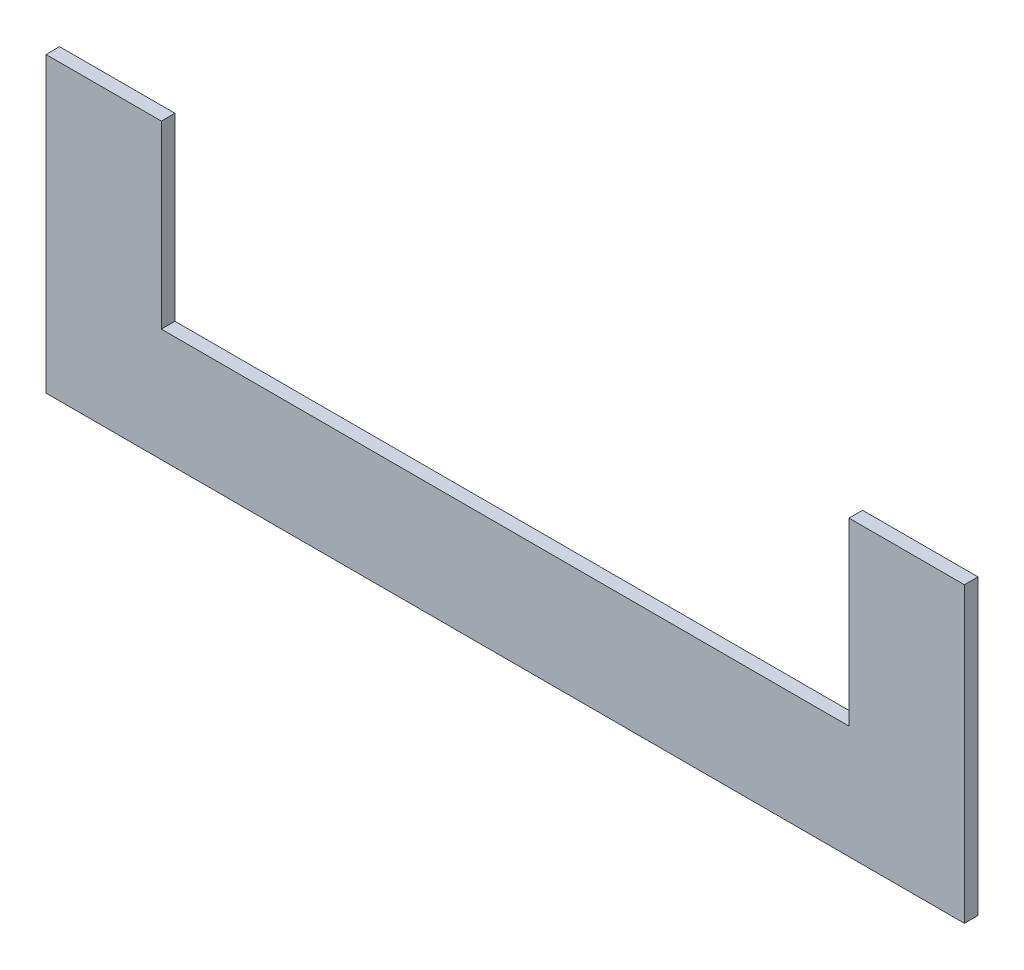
ISO-10303-21;
HEADER;
FILE_DESCRIPTION(('STEP AP214'),'2;1');
FILE_NAME('part.step','',(''),(''),'','','');
FILE_SCHEMA(('AUTOMOTIVE_DESIGN { 1 0 10303 214 1 1 1 1 }'));
ENDSEC;
DATA;
#1=APPLICATION_CONTEXT('core data for automotive mechanical design processes');
#2=APPLICATION_PROTOCOL_DEFINITION('international standard','automotive_design',2000,#1);
#3=PRODUCT_CONTEXT('',#1,'mechanical');
#4=PRODUCT('Part','Part','',(#3));
#5=PRODUCT_RELATED_PRODUCT_CATEGORY('part','',(#4));
#6=PRODUCT_DEFINITION_FORMATION('','',#4);
#7=PRODUCT_DEFINITION_CONTEXT('part definition',#1,'design');
#8=PRODUCT_DEFINITION('design','',#6,#7);
#9=PRODUCT_DEFINITION_SHAPE('','',#8);
#10=(LENGTH_UNIT() NAMED_UNIT(*) SI_UNIT(.MILLI.,.METRE.));
#11=(NAMED_UNIT(*) PLANE_ANGLE_UNIT() SI_UNIT($,.RADIAN.));
#12=(NAMED_UNIT(*) SI_UNIT($,.STERADIAN.) SOLID_ANGLE_UNIT());
#13=UNCERTAINTY_MEASURE_WITH_UNIT(LENGTH_MEASURE(1.E-05),#10,'distance_accuracy_value','');
#14=(GEOMETRIC_REPRESENTATION_CONTEXT(3) GLOBAL_UNCERTAINTY_ASSIGNED_CONTEXT((#13)) GLOBAL_UNIT_ASSIGNED_CONTEXT((#10,
#11,#12)) REPRESENTATION_CONTEXT('',''));
#15=CARTESIAN_POINT('',(0.,0.,0.));
#16=DIRECTION('',(0.,0.,1.));
#17=DIRECTION('',(1.,0.,0.));
#18=AXIS2_PLACEMENT_3D('',#15,#16,#17);
#19=CARTESIAN_POINT('',(-203.,-64.8200000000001,6.));
#20=DIRECTION('',(1.,0.,0.));
#21=DIRECTION('',(0.,0.,-1.));
#22=AXIS2_PLACEMENT_3D('',#19,#20,#21);
#23=PLANE('',#22);
#24=DIRECTION('',(0.,-1.,0.));
#25=VECTOR('',#24,1.);
#26=CARTESIAN_POINT('',(-203.,-64.8200000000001,0.));
#27=LINE('',#26,#25);
#28=CARTESIAN_POINT('',(-203.,64.8199999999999,0.));
#29=VERTEX_POINT('',#28);
#30=CARTESIAN_POINT('',(-203.,-64.8200000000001,0.));
#31=VERTEX_POINT('',#30);
#32=EDGE_CURVE('E128',#29,#31,#27,.T.);
#33=ORIENTED_EDGE('',*,*,#32,.T.);
#34=DIRECTION('',(0.,0.,-1.));
#35=VECTOR('',#34,1.);
#36=CARTESIAN_POINT('',(-203.,-64.8200000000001,6.));
#37=LINE('',#36,#35);
#38=CARTESIAN_POINT('',(-203.,-64.8200000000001,6.));
#39=VERTEX_POINT('',#38);
#40=EDGE_CURVE('E11',#39,#31,#37,.T.);
#41=ORIENTED_EDGE('',*,*,#40,.F.);
#42=DIRECTION('',(0.,-1.,0.));
#43=VECTOR('',#42,1.);
#44=CARTESIAN_POINT('',(-203.,-64.8200000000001,6.));
#45=LINE('',#44,#43);
#46=CARTESIAN_POINT('',(-203.,64.8199999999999,6.));
#47=VERTEX_POINT('',#46);
#48=EDGE_CURVE('E142',#47,#39,#45,.T.);
#49=ORIENTED_EDGE('',*,*,#48,.F.);
#50=DIRECTION('',(0.,0.,-1.));
#51=VECTOR('',#50,1.);
#52=CARTESIAN_POINT('',(-203.,64.8199999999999,6.));
#53=LINE('',#52,#51);
#54=EDGE_CURVE('E124',#47,#29,#53,.T.);
#55=ORIENTED_EDGE('',*,*,#54,.T.);
#56=EDGE_LOOP('',(#33,#41,#49,#55));
#57=FACE_BOUND('',#56,.T.);
#58=ADVANCED_FACE('F32',(#57),#23,.F.);
#59=CARTESIAN_POINT('',(203.,-64.82,6.));
#60=DIRECTION('',(0.,1.,0.));
#61=DIRECTION('',(-1.,0.,0.));
#62=AXIS2_PLACEMENT_3D('',#59,#60,#61);
#63=PLANE('',#62);
#64=DIRECTION('',(1.,0.,0.));
#65=VECTOR('',#64,1.);
#66=CARTESIAN_POINT('',(203.,-64.82,0.));
#67=LINE('',#66,#65);
#68=CARTESIAN_POINT('',(203.,-64.82,0.));
#69=VERTEX_POINT('',#68);
#70=EDGE_CURVE('E131',#31,#69,#67,.T.);
#71=ORIENTED_EDGE('',*,*,#70,.T.);
#72=DIRECTION('',(0.,0.,-1.));
#73=VECTOR('',#72,1.);
#74=CARTESIAN_POINT('',(203.,-64.82,6.));
#75=LINE('',#74,#73);
#76=CARTESIAN_POINT('',(203.,-64.82,6.));
#77=VERTEX_POINT('',#76);
#78=EDGE_CURVE('E40',#77,#69,#75,.T.);
#79=ORIENTED_EDGE('',*,*,#78,.F.);
#80=DIRECTION('',(1.,0.,0.));
#81=VECTOR('',#80,1.);
#82=CARTESIAN_POINT('',(203.,-64.82,6.));
#83=LINE('',#82,#81);
#84=EDGE_CURVE('E91',#39,#77,#83,.T.);
#85=ORIENTED_EDGE('',*,*,#84,.F.);
#86=ORIENTED_EDGE('',*,*,#40,.T.);
#87=EDGE_LOOP('',(#71,#79,#85,#86));
#88=FACE_BOUND('',#87,.T.);
#89=ADVANCED_FACE('F177',(#88),#63,.F.);
#90=CARTESIAN_POINT('',(203.,-64.82,6.));
#91=DIRECTION('',(-1.,0.,0.));
#92=DIRECTION('',(0.,0.,1.));
#93=AXIS2_PLACEMENT_3D('',#90,#91,#92);
#94=PLANE('',#93);
#95=DIRECTION('',(0.,1.,0.));
#96=VECTOR('',#95,1.);
#97=CARTESIAN_POINT('',(203.,-64.82,0.));
#98=LINE('',#97,#96);
#99=CARTESIAN_POINT('',(203.,64.82,0.));
#100=VERTEX_POINT('',#99);
#101=EDGE_CURVE('E133',#69,#100,#98,.T.);
#102=ORIENTED_EDGE('',*,*,#101,.T.);
#103=DIRECTION('',(0.,0.,-1.));
#104=VECTOR('',#103,1.);
#105=CARTESIAN_POINT('',(203.,64.82,6.));
#106=LINE('',#105,#104);
#107=CARTESIAN_POINT('',(203.,64.82,6.));
#108=VERTEX_POINT('',#107);
#109=EDGE_CURVE('E149',#108,#100,#106,.T.);
#110=ORIENTED_EDGE('',*,*,#109,.F.);
#111=DIRECTION('',(0.,1.,0.));
#112=VECTOR('',#111,1.);
#113=CARTESIAN_POINT('',(203.,-64.82,6.));
#114=LINE('',#113,#112);
#115=EDGE_CURVE('E157',#77,#108,#114,.T.);
#116=ORIENTED_EDGE('',*,*,#115,.F.);
#117=ORIENTED_EDGE('',*,*,#78,.T.);
#118=EDGE_LOOP('',(#102,#110,#116,#117));
#119=FACE_BOUND('',#118,.T.);
#120=ADVANCED_FACE('F155',(#119),#94,.F.);
#121=CARTESIAN_POINT('',(152.,64.82,6.));
#122=DIRECTION('',(0.,-1.,0.));
#123=DIRECTION('',(1.,0.,0.));
#124=AXIS2_PLACEMENT_3D('',#121,#122,#123);
#125=PLANE('',#124);
#126=DIRECTION('',(-1.,0.,0.));
#127=VECTOR('',#126,1.);
#128=CARTESIAN_POINT('',(152.,64.82,0.));
#129=LINE('',#128,#127);
#130=CARTESIAN_POINT('',(152.,64.82,0.));
#131=VERTEX_POINT('',#130);
#132=EDGE_CURVE('E135',#100,#131,#129,.T.);
#133=ORIENTED_EDGE('',*,*,#132,.T.);
#134=DIRECTION('',(0.,0.,-1.));
#135=VECTOR('',#134,1.);
#136=CARTESIAN_POINT('',(152.,64.82,6.));
#137=LINE('',#136,#135);
#138=CARTESIAN_POINT('',(152.,64.82,6.));
#139=VERTEX_POINT('',#138);
#140=EDGE_CURVE('E146',#139,#131,#137,.T.);
#141=ORIENTED_EDGE('',*,*,#140,.F.);
#142=DIRECTION('',(-1.,0.,0.));
#143=VECTOR('',#142,1.);
#144=CARTESIAN_POINT('',(152.,64.82,6.));
#145=LINE('',#144,#143);
#146=EDGE_CURVE('E169',#108,#139,#145,.T.);
#147=ORIENTED_EDGE('',*,*,#146,.F.);
#148=ORIENTED_EDGE('',*,*,#109,.T.);
#149=EDGE_LOOP('',(#133,#141,#147,#148));
#150=FACE_BOUND('',#149,.T.);
#151=ADVANCED_FACE('F165',(#150),#125,.F.);
#152=CARTESIAN_POINT('',(152.,-14.82,6.));
#153=DIRECTION('',(1.,0.,0.));
#154=DIRECTION('',(0.,1.,0.));
#155=AXIS2_PLACEMENT_3D('',#152,#153,#154);
#156=PLANE('',#155);
#157=DIRECTION('',(0.,-1.,0.));
#158=VECTOR('',#157,1.);
#159=CARTESIAN_POINT('',(152.,-14.82,0.));
#160=LINE('',#159,#158);
#161=CARTESIAN_POINT('',(152.,-14.82,0.));
#162=VERTEX_POINT('',#161);
#163=EDGE_CURVE('E137',#131,#162,#160,.T.);
#164=ORIENTED_EDGE('',*,*,#163,.T.);
#165=DIRECTION('',(0.,0.,-1.));
#166=VECTOR('',#165,1.);
#167=CARTESIAN_POINT('',(152.,-14.82,6.));
#168=LINE('',#167,#166);
#169=CARTESIAN_POINT('',(152.,-14.82,6.));
#170=VERTEX_POINT('',#169);
#171=EDGE_CURVE('E119',#170,#162,#168,.T.);
#172=ORIENTED_EDGE('',*,*,#171,.F.);
#173=DIRECTION('',(0.,-1.,0.));
#174=VECTOR('',#173,1.);
#175=CARTESIAN_POINT('',(152.,-14.82,6.));
#176=LINE('',#175,#174);
#177=EDGE_CURVE('E110',#139,#170,#176,.T.);
#178=ORIENTED_EDGE('',*,*,#177,.F.);
#179=ORIENTED_EDGE('',*,*,#140,.T.);
#180=EDGE_LOOP('',(#164,#172,#178,#179));
#181=FACE_BOUND('',#180,.T.);
#182=ADVANCED_FACE('F168',(#181),#156,.F.);
#183=CARTESIAN_POINT('',(-152.,-14.82,6.));
#184=DIRECTION('',(0.,-1.,0.));
#185=DIRECTION('',(0.,0.,-1.));
#186=AXIS2_PLACEMENT_3D('',#183,#184,#185);
#187=PLANE('',#186);
#188=DIRECTION('',(-1.,0.,0.));
#189=VECTOR('',#188,1.);
#190=CARTESIAN_POINT('',(-152.,-14.82,0.));
#191=LINE('',#190,#189);
#192=CARTESIAN_POINT('',(-152.,-14.82,0.));
#193=VERTEX_POINT('',#192);
#194=EDGE_CURVE('E118',#162,#193,#191,.T.);
#195=ORIENTED_EDGE('',*,*,#194,.T.);
#196=DIRECTION('',(0.,0.,-1.));
#197=VECTOR('',#196,1.);
#198=CARTESIAN_POINT('',(-152.,-14.82,6.));
#199=LINE('',#198,#197);
#200=CARTESIAN_POINT('',(-152.,-14.82,6.));
#201=VERTEX_POINT('',#200);
#202=EDGE_CURVE('E115',#201,#193,#199,.T.);
#203=ORIENTED_EDGE('',*,*,#202,.F.);
#204=DIRECTION('',(-1.,0.,0.));
#205=VECTOR('',#204,1.);
#206=CARTESIAN_POINT('',(-152.,-14.82,6.));
#207=LINE('',#206,#205);
#208=EDGE_CURVE('E104',#170,#201,#207,.T.);
#209=ORIENTED_EDGE('',*,*,#208,.F.);
#210=ORIENTED_EDGE('',*,*,#171,.T.);
#211=EDGE_LOOP('',(#195,#203,#209,#210));
#212=FACE_BOUND('',#211,.T.);
#213=ADVANCED_FACE('F116',(#212),#187,.F.);
#214=CARTESIAN_POINT('',(-152.,-14.82,6.));
#215=DIRECTION('',(-1.,0.,0.));
#216=DIRECTION('',(0.,0.,1.));
#217=AXIS2_PLACEMENT_3D('',#214,#215,#216);
#218=PLANE('',#217);
#219=DIRECTION('',(0.,1.,0.));
#220=VECTOR('',#219,1.);
#221=CARTESIAN_POINT('',(-152.,-14.82,0.));
#222=LINE('',#221,#220);
#223=CARTESIAN_POINT('',(-152.,64.8199999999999,0.));
#224=VERTEX_POINT('',#223);
#225=EDGE_CURVE('E77',#193,#224,#222,.T.);
#226=ORIENTED_EDGE('',*,*,#225,.T.);
#227=DIRECTION('',(0.,0.,-1.));
#228=VECTOR('',#227,1.);
#229=CARTESIAN_POINT('',(-152.,64.8199999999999,6.));
#230=LINE('',#229,#228);
#231=CARTESIAN_POINT('',(-152.,64.8199999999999,6.));
#232=VERTEX_POINT('',#231);
#233=EDGE_CURVE('E120',#232,#224,#230,.T.);
#234=ORIENTED_EDGE('',*,*,#233,.F.);
#235=DIRECTION('',(0.,1.,0.));
#236=VECTOR('',#235,1.);
#237=CARTESIAN_POINT('',(-152.,-14.82,6.));
#238=LINE('',#237,#236);
#239=EDGE_CURVE('E108',#201,#232,#238,.T.);
#240=ORIENTED_EDGE('',*,*,#239,.F.);
#241=ORIENTED_EDGE('',*,*,#202,.T.);
#242=EDGE_LOOP('',(#226,#234,#240,#241));
#243=FACE_BOUND('',#242,.T.);
#244=ADVANCED_FACE('F122',(#243),#218,.F.);
#245=CARTESIAN_POINT('',(-203.,64.8199999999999,6.));
#246=DIRECTION('',(0.,-1.,0.));
#247=DIRECTION('',(0.,0.,-1.));
#248=AXIS2_PLACEMENT_3D('',#245,#246,#247);
#249=PLANE('',#248);
#250=DIRECTION('',(-1.,0.,0.));
#251=VECTOR('',#250,1.);
#252=CARTESIAN_POINT('',(-203.,64.8199999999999,0.));
#253=LINE('',#252,#251);
#254=EDGE_CURVE('E83',#224,#29,#253,.T.);
#255=ORIENTED_EDGE('',*,*,#254,.T.);
#256=ORIENTED_EDGE('',*,*,#54,.F.);
#257=DIRECTION('',(-1.,0.,0.));
#258=VECTOR('',#257,1.);
#259=CARTESIAN_POINT('',(-203.,64.8199999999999,6.));
#260=LINE('',#259,#258);
#261=EDGE_CURVE('E48',#232,#47,#260,.T.);
#262=ORIENTED_EDGE('',*,*,#261,.F.);
#263=ORIENTED_EDGE('',*,*,#233,.T.);
#264=EDGE_LOOP('',(#255,#256,#262,#263));
#265=FACE_BOUND('',#264,.T.);
#266=ADVANCED_FACE('F193',(#265),#249,.F.);
#267=CARTESIAN_POINT('',(0.,0.,6.));
#268=DIRECTION('',(0.,0.,-1.));
#269=DIRECTION('',(-1.,0.,0.));
#270=AXIS2_PLACEMENT_3D('',#267,#268,#269);
#271=PLANE('',#270);
#272=ORIENTED_EDGE('',*,*,#48,.T.);
#273=ORIENTED_EDGE('',*,*,#84,.T.);
#274=ORIENTED_EDGE('',*,*,#115,.T.);
#275=ORIENTED_EDGE('',*,*,#146,.T.);
#276=ORIENTED_EDGE('',*,*,#177,.T.);
#277=ORIENTED_EDGE('',*,*,#208,.T.);
#278=ORIENTED_EDGE('',*,*,#239,.T.);
#279=ORIENTED_EDGE('',*,*,#261,.T.);
#280=EDGE_LOOP('',(#272,#273,#274,#275,#276,#277,#278,#279));
#281=FACE_BOUND('',#280,.T.);
#282=ADVANCED_FACE('F106',(#281),#271,.F.);
#283=CARTESIAN_POINT('',(0.,0.,0.));
#284=DIRECTION('',(0.,0.,-1.));
#285=DIRECTION('',(-1.,0.,0.));
#286=AXIS2_PLACEMENT_3D('',#283,#284,#285);
#287=PLANE('',#286);
#288=ORIENTED_EDGE('',*,*,#32,.F.);
#289=ORIENTED_EDGE('',*,*,#254,.F.);
#290=ORIENTED_EDGE('',*,*,#225,.F.);
#291=ORIENTED_EDGE('',*,*,#194,.F.);
#292=ORIENTED_EDGE('',*,*,#163,.F.);
#293=ORIENTED_EDGE('',*,*,#132,.F.);
#294=ORIENTED_EDGE('',*,*,#101,.F.);
#295=ORIENTED_EDGE('',*,*,#70,.F.);
#296=EDGE_LOOP('',(#288,#289,#290,#291,#292,#293,#294,#295));
#297=FACE_BOUND('',#296,.T.);
#298=ADVANCED_FACE('F161',(#297),#287,.T.);
#299=CLOSED_SHELL('',(#58,#89,#120,#151,#182,#213,#244,#266,#282,#298));
#300=MANIFOLD_SOLID_BREP('B2',#299);
#301=ADVANCED_BREP_SHAPE_REPRESENTATION('',(#18,#300),#14);
#302=SHAPE_DEFINITION_REPRESENTATION(#9,#301);
ENDSEC;
END-ISO-10303-21;
